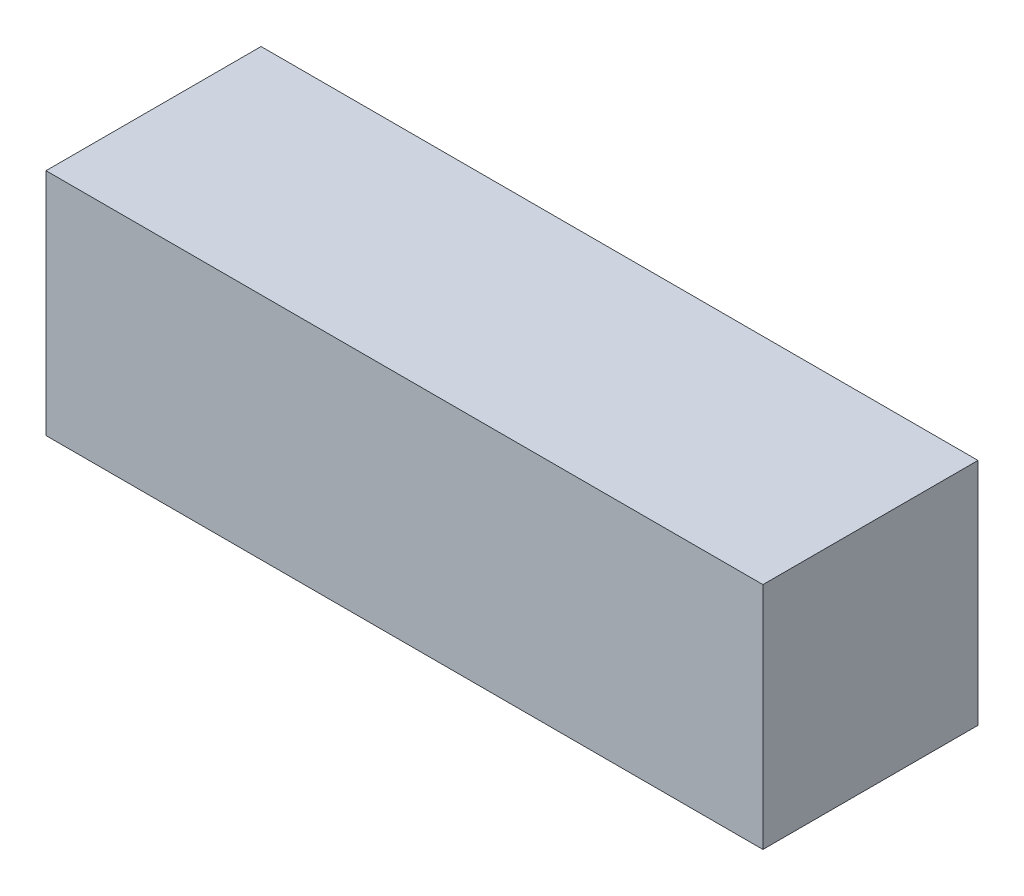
from build123d import *

# Parameters (mm, degrees)
SKETCH2_W           = 10
SKETCH2_H           = 3.2
BOSS_EXTRUDE1_DEPTH = 3


with BuildPart() as part:
    # Sketch2 → Boss-Extrude1 (new body)
    with BuildSketch(Plane.XY):
        with Locations((5, 1.6)):
            Rectangle(SKETCH2_W, SKETCH2_H)
    extrude(amount=BOSS_EXTRUDE1_DEPTH)


solid = part.part
